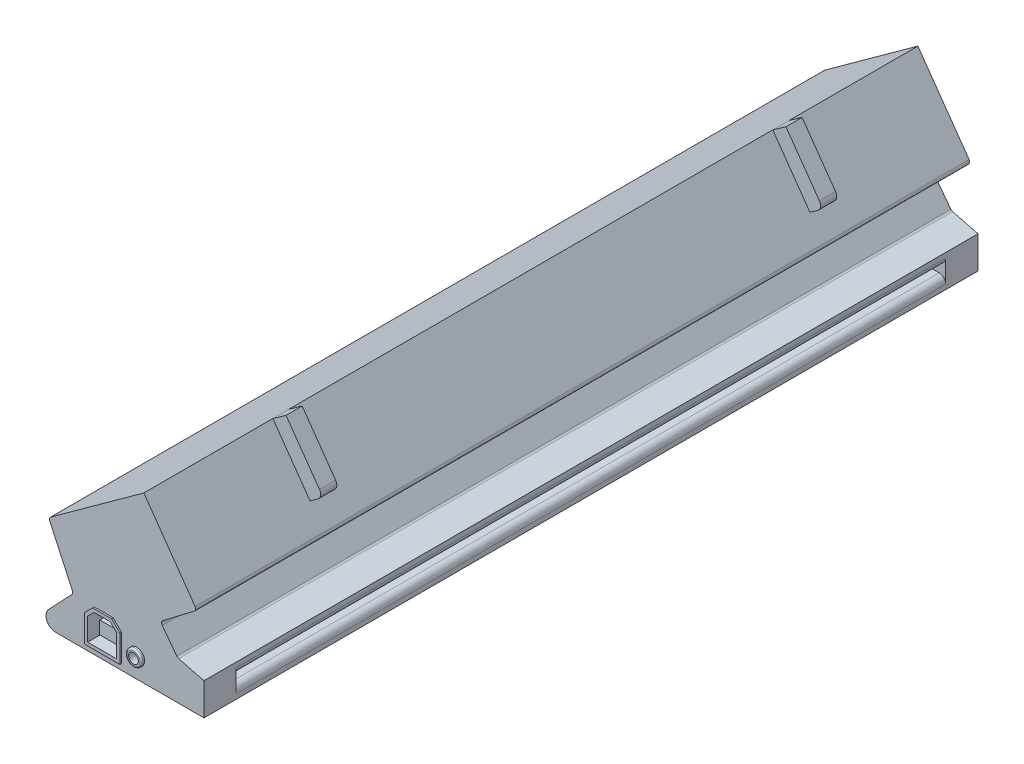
from build123d import *

# Parameters (mm, degrees)
ESTRUSIONE_ESTRUSIONE1_DEPTH = 120
ESTRUSIONE_ESTRUSIONE2_DEPTH = 5
SCHIZZO3_W                   = 220
SCHIZZO3_H                   = 3
TAGLIO_ESTRUSIONE1_DEPTH     = 20
TAGLIO_ESTRUSIONE2_DEPTH     = 15
SCHIZZO6_W                   = 6.5
SCHIZZO6_H                   = 4
ESTRUSIONE_ESTRUSIONE3_DEPTH = 13
RACCORDO1_R                  = 2
SCHIZZO7_R                   = 2.471812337
SCHIZZO7_R_2                 = 1.511708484
ESTRUSIONE_ESTRUSIONE4_DEPTH = 1
TAGLIO_ESTRUSIONE3_START     = -5
SCHIZZO8_R                   = 1.511708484
TAGLIO_ESTRUSIONE3_DEPTH     = 5
RACCORDO2_R                  = 0.5
ESTRUSIONE_ESTRUSIONE5_DEPTH = 0.5
RACCORDO3_R                  = 1
RACCORDO4_R                  = 1
RACCORDO5_R                  = 2


with BuildPart() as part:
    # Schizzo1 → Estrusione-Estrusione1 (new, symmetric)
    with BuildSketch(Plane.XY):
        with BuildLine():
            Line((-4.156117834, 0), (41.819467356, 0))
            Line((41.819467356, 0), (41.819467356, 10))
            Line((41.819467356, 10), (33.626635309, 12.110816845))
            Line((33.626635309, 12.110816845), (28.273464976, 19.15446202))
            Line((28.273464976, 19.15446202), (39.62374, 27.780671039))
            Line((39.62374, 27.780671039), (23.180065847, 51.091997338))
            Line((23.180065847, 51.091997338), (-6.338138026, 29.715220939))
            Line((-6.338138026, 29.715220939), (1.319651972, 13.174819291))
            Line((1.319651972, 13.174819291), (-6.338138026, 5.058831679))
            ThreePointArc((-6.338138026, 5.058831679), (-6.910795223, 1.811828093), (-4.156117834, 0))
        make_face()
    extrude(amount=ESTRUSIONE_ESTRUSIONE1_DEPTH, both=True)

    # Schizzo2 → Estrusione-Estrusione2 (add)
    with BuildSketch(Plane(origin=(39.543814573, 27.893977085, 0), x_dir=(0, 0, -1), z_dir=(0.817155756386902, 0.5764169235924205, 0))):
        Polygon((-75, 28.388737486), (-75, 18.388737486), (-75, 8.388737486), (-80, 8.388737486), (-80, 28.388737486), align=None)
        Polygon((75, 18.388737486), (75, 28.388737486), (80, 28.388737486), (80, 8.388737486), (75, 8.388737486), align=None)
    extrude(amount=ESTRUSIONE_ESTRUSIONE2_DEPTH)

    # Schizzo3 → Taglio-Estrusione1 (cut)
    with BuildSketch(Plane(origin=(41.819467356, 0, 0), x_dir=(0, 0, -1), z_dir=(1, 0, 0))):
        with Locations((0, 5)):
            Rectangle(SCHIZZO3_W, SCHIZZO3_H)
    extrude(amount=-TAGLIO_ESTRUSIONE1_DEPTH, mode=Mode.SUBTRACT)

    # Schizzo5 → Taglio-Estrusione2 (cut)
    with BuildSketch(Plane.XY.offset(120)):
        Polygon((6.246047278, 2.811606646), (15.246047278, 2.811606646), (15.246047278, 9.811606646), (13.246047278, 11.811606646), (8.246047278, 11.811606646), (6.246047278, 9.811606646), align=None)
    extrude(amount=-TAGLIO_ESTRUSIONE2_DEPTH, mode=Mode.SUBTRACT)

    # Schizzo6 → Estrusione-Estrusione3 (add)
    with BuildSketch(Plane.XY.offset(105)):
        with Locations((10.746047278, 6.152724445)):
            Rectangle(SCHIZZO6_W, SCHIZZO6_H)
    extrude(amount=ESTRUSIONE_ESTRUSIONE3_DEPTH)

    # Raccordo1
    raccordo1_edges = [part.edges().sort_by_distance(p)[0] for p in [
        (41.819467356, 6.5, 0),
        (41.819467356, 3.5, 0),
    ]]
    fillet(raccordo1_edges, radius=RACCORDO1_R)

    # Schizzo7 → Estrusione-Estrusione4 (add)
    with BuildSketch(Plane.XY.offset(120)):
        with Locations(Location((20.966174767, 6.094179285, 0), (0, 0, 180))):
            Circle(SCHIZZO7_R)
        with Locations((20.966174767, 6.094179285)):
            Circle(SCHIZZO7_R_2, mode=Mode.SUBTRACT)
    extrude(amount=ESTRUSIONE_ESTRUSIONE4_DEPTH)

    # Schizzo8 → Taglio-Estrusione3 (cut)
    with BuildSketch(Plane.XY.offset(120).offset(TAGLIO_ESTRUSIONE3_START)):
        with Locations((20.966174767, 6.094179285)):
            Circle(SCHIZZO8_R)
    extrude(amount=TAGLIO_ESTRUSIONE3_DEPTH, mode=Mode.SUBTRACT)

    # Raccordo2
    raccordo2_edges = [part.edges().sort_by_distance(p)[0] for p in [
        (23.437987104, 6.094179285, 121),
    ]]
    fillet(raccordo2_edges, radius=RACCORDO2_R)

    # Schizzo9 → Estrusione-Estrusione5 (add)
    with BuildSketch(Plane.XY.offset(120)):
        Polygon((5.246047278, 1.811606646), (5.246047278, 10.225820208), (7.831833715, 12.811606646), (13.66026084, 12.811606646), (16.246047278, 10.225820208), (16.246047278, 1.811606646), align=None)
        Polygon((6.246047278, 9.811606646), (8.246047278, 11.811606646), (13.246047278, 11.811606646), (15.246047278, 9.811606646), (15.246047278, 2.811606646), (6.246047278, 2.811606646), align=None, mode=Mode.SUBTRACT)
    extrude(amount=ESTRUSIONE_ESTRUSIONE5_DEPTH)

    # Raccordo3
    raccordo3_edges = [part.edges().sort_by_distance(p)[0] for p in [
        (39.62374, 27.780671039, 0),
        (28.273464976, 19.15446202, 0),
        (33.626635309, 12.110816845, 0),
    ]]
    fillet(raccordo3_edges, radius=RACCORDO3_R)

    # Raccordo4
    raccordo4_edges = [part.edges().sort_by_distance(p)[0] for p in [
        (1.319651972, 13.174819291, 0),
        (-6.338138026, 29.715220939, 0),
    ]]
    fillet(raccordo4_edges, radius=RACCORDO4_R)

    # Raccordo5
    raccordo5_edges = [part.edges().sort_by_distance(p)[0] for p in [
        (38.794183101, 37.630966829, 77.5),
        (38.794183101, 37.630966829, -77.5),
    ]]
    fillet(raccordo5_edges, radius=RACCORDO5_R)


solid = part.part
